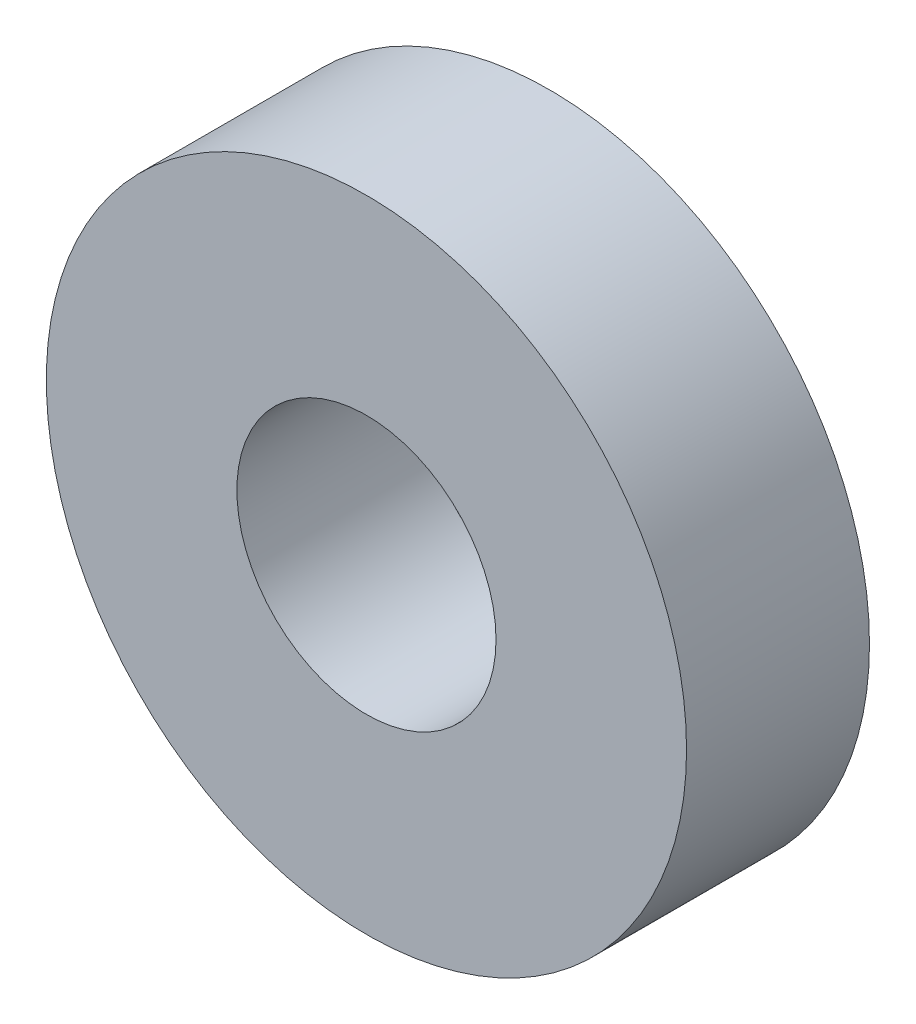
ISO-10303-21;
HEADER;
FILE_DESCRIPTION(('STEP AP214'),'2;1');
FILE_NAME('part.step','',(''),(''),'','','');
FILE_SCHEMA(('AUTOMOTIVE_DESIGN { 1 0 10303 214 1 1 1 1 }'));
ENDSEC;
DATA;
#1=APPLICATION_CONTEXT('core data for automotive mechanical design processes');
#2=APPLICATION_PROTOCOL_DEFINITION('international standard','automotive_design',2000,#1);
#3=PRODUCT_CONTEXT('',#1,'mechanical');
#4=PRODUCT('Part','Part','',(#3));
#5=PRODUCT_RELATED_PRODUCT_CATEGORY('part','',(#4));
#6=PRODUCT_DEFINITION_FORMATION('','',#4);
#7=PRODUCT_DEFINITION_CONTEXT('part definition',#1,'design');
#8=PRODUCT_DEFINITION('design','',#6,#7);
#9=PRODUCT_DEFINITION_SHAPE('','',#8);
#10=(LENGTH_UNIT() NAMED_UNIT(*) SI_UNIT(.MILLI.,.METRE.));
#11=(NAMED_UNIT(*) PLANE_ANGLE_UNIT() SI_UNIT($,.RADIAN.));
#12=(NAMED_UNIT(*) SI_UNIT($,.STERADIAN.) SOLID_ANGLE_UNIT());
#13=UNCERTAINTY_MEASURE_WITH_UNIT(LENGTH_MEASURE(1.E-05),#10,'distance_accuracy_value','');
#14=(GEOMETRIC_REPRESENTATION_CONTEXT(3) GLOBAL_UNCERTAINTY_ASSIGNED_CONTEXT((#13)) GLOBAL_UNIT_ASSIGNED_CONTEXT((#10,
#11,#12)) REPRESENTATION_CONTEXT('',''));
#15=CARTESIAN_POINT('',(0.,0.,0.));
#16=DIRECTION('',(0.,0.,1.));
#17=DIRECTION('',(1.,0.,0.));
#18=AXIS2_PLACEMENT_3D('',#15,#16,#17);
#19=CARTESIAN_POINT('',(0.,0.,12.));
#20=DIRECTION('',(0.,0.,1.));
#21=DIRECTION('',(1.,0.,0.));
#22=AXIS2_PLACEMENT_3D('',#19,#20,#21);
#23=PLANE('',#22);
#24=CARTESIAN_POINT('',(0.,0.,12.));
#25=DIRECTION('',(0.,0.,1.));
#26=DIRECTION('',(1.,0.,0.));
#27=AXIS2_PLACEMENT_3D('',#24,#25,#26);
#28=CIRCLE('',#27,21.);
#29=CARTESIAN_POINT('',(21.,0.,12.));
#30=VERTEX_POINT('',#29);
#31=EDGE_CURVE('E10',#30,#30,#28,.T.);
#32=ORIENTED_EDGE('',*,*,#31,.T.);
#33=EDGE_LOOP('',(#32));
#34=FACE_BOUND('',#33,.T.);
#35=CARTESIAN_POINT('',(0.,0.,12.));
#36=DIRECTION('',(0.,0.,1.));
#37=DIRECTION('',(1.,0.,0.));
#38=AXIS2_PLACEMENT_3D('',#35,#36,#37);
#39=CIRCLE('',#38,8.5);
#40=CARTESIAN_POINT('',(8.5,0.,12.));
#41=VERTEX_POINT('',#40);
#42=EDGE_CURVE('E41',#41,#41,#39,.T.);
#43=ORIENTED_EDGE('',*,*,#42,.F.);
#44=EDGE_LOOP('',(#43));
#45=FACE_BOUND('',#44,.T.);
#46=ADVANCED_FACE('F30',(#34,#45),#23,.T.);
#47=CARTESIAN_POINT('',(0.,0.,0.));
#48=DIRECTION('',(0.,0.,1.));
#49=DIRECTION('',(1.,0.,0.));
#50=AXIS2_PLACEMENT_3D('',#47,#48,#49);
#51=PLANE('',#50);
#52=CARTESIAN_POINT('',(0.,0.,0.));
#53=DIRECTION('',(0.,0.,1.));
#54=DIRECTION('',(1.,0.,0.));
#55=AXIS2_PLACEMENT_3D('',#52,#53,#54);
#56=CIRCLE('',#55,21.);
#57=CARTESIAN_POINT('',(21.,0.,0.));
#58=VERTEX_POINT('',#57);
#59=EDGE_CURVE('E34',#58,#58,#56,.T.);
#60=ORIENTED_EDGE('',*,*,#59,.F.);
#61=EDGE_LOOP('',(#60));
#62=FACE_BOUND('',#61,.T.);
#63=CARTESIAN_POINT('',(0.,0.,0.));
#64=DIRECTION('',(0.,0.,1.));
#65=DIRECTION('',(1.,0.,0.));
#66=AXIS2_PLACEMENT_3D('',#63,#64,#65);
#67=CIRCLE('',#66,8.5);
#68=CARTESIAN_POINT('',(8.5,0.,0.));
#69=VERTEX_POINT('',#68);
#70=EDGE_CURVE('E43',#69,#69,#67,.T.);
#71=ORIENTED_EDGE('',*,*,#70,.T.);
#72=EDGE_LOOP('',(#71));
#73=FACE_BOUND('',#72,.T.);
#74=ADVANCED_FACE('F53',(#62,#73),#51,.F.);
#75=CARTESIAN_POINT('',(0.,0.,12.));
#76=DIRECTION('',(0.,0.,-1.));
#77=DIRECTION('',(-1.,0.,0.));
#78=AXIS2_PLACEMENT_3D('',#75,#76,#77);
#79=CYLINDRICAL_SURFACE('',#78,21.);
#80=ORIENTED_EDGE('',*,*,#31,.F.);
#81=EDGE_LOOP('',(#80));
#82=FACE_BOUND('',#81,.T.);
#83=ORIENTED_EDGE('',*,*,#59,.T.);
#84=EDGE_LOOP('',(#83));
#85=FACE_BOUND('',#84,.T.);
#86=ADVANCED_FACE('F32',(#82,#85),#79,.T.);
#87=CARTESIAN_POINT('',(0.,0.,12.));
#88=DIRECTION('',(0.,0.,-1.));
#89=DIRECTION('',(-1.,0.,0.));
#90=AXIS2_PLACEMENT_3D('',#87,#88,#89);
#91=CYLINDRICAL_SURFACE('',#90,8.5);
#92=ORIENTED_EDGE('',*,*,#42,.T.);
#93=EDGE_LOOP('',(#92));
#94=FACE_BOUND('',#93,.T.);
#95=ORIENTED_EDGE('',*,*,#70,.F.);
#96=EDGE_LOOP('',(#95));
#97=FACE_BOUND('',#96,.T.);
#98=ADVANCED_FACE('F49',(#94,#97),#91,.F.);
#99=CLOSED_SHELL('',(#46,#74,#86,#98));
#100=MANIFOLD_SOLID_BREP('B2',#99);
#101=ADVANCED_BREP_SHAPE_REPRESENTATION('',(#18,#100),#14);
#102=SHAPE_DEFINITION_REPRESENTATION(#9,#101);
ENDSEC;
END-ISO-10303-21;
